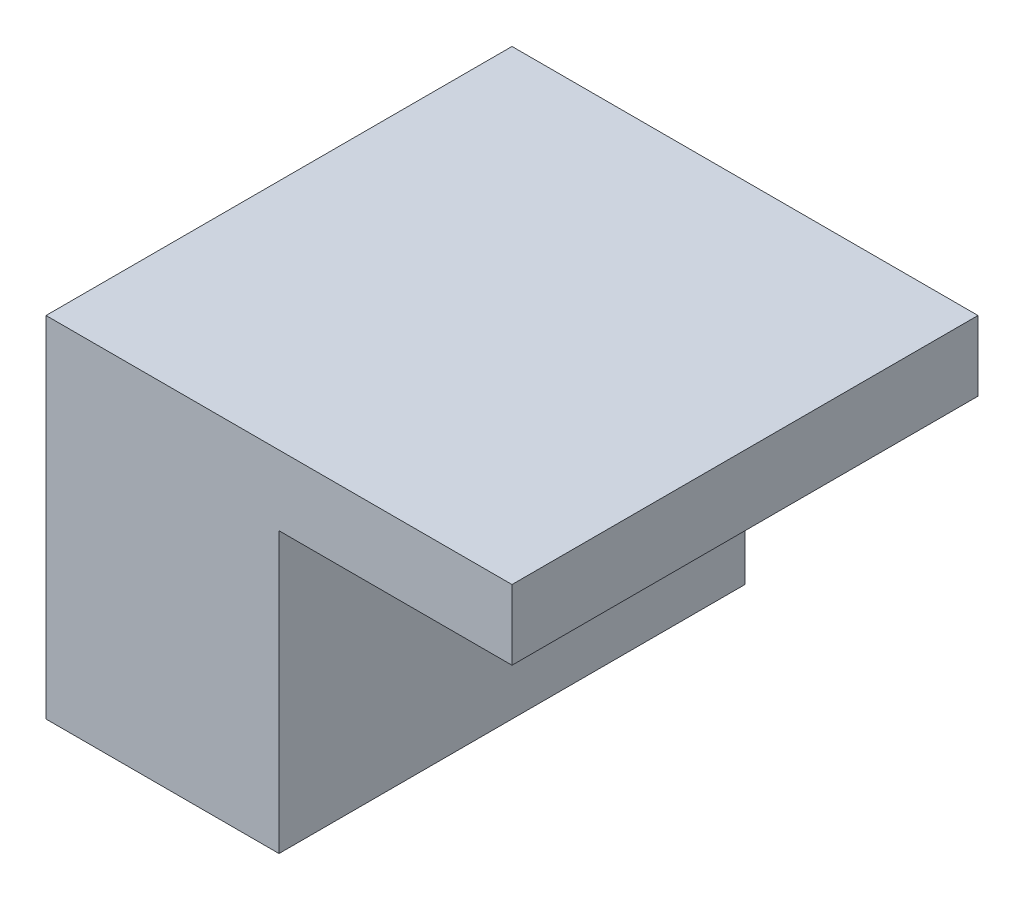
ISO-10303-21;
HEADER;
FILE_DESCRIPTION(('STEP AP214'),'2;1');
FILE_NAME('part.step','',(''),(''),'','','');
FILE_SCHEMA(('AUTOMOTIVE_DESIGN { 1 0 10303 214 1 1 1 1 }'));
ENDSEC;
DATA;
#1=APPLICATION_CONTEXT('core data for automotive mechanical design processes');
#2=APPLICATION_PROTOCOL_DEFINITION('international standard','automotive_design',2000,#1);
#3=PRODUCT_CONTEXT('',#1,'mechanical');
#4=PRODUCT('Part','Part','',(#3));
#5=PRODUCT_RELATED_PRODUCT_CATEGORY('part','',(#4));
#6=PRODUCT_DEFINITION_FORMATION('','',#4);
#7=PRODUCT_DEFINITION_CONTEXT('part definition',#1,'design');
#8=PRODUCT_DEFINITION('design','',#6,#7);
#9=PRODUCT_DEFINITION_SHAPE('','',#8);
#10=(LENGTH_UNIT() NAMED_UNIT(*) SI_UNIT(.MILLI.,.METRE.));
#11=(NAMED_UNIT(*) PLANE_ANGLE_UNIT() SI_UNIT($,.RADIAN.));
#12=(NAMED_UNIT(*) SI_UNIT($,.STERADIAN.) SOLID_ANGLE_UNIT());
#13=UNCERTAINTY_MEASURE_WITH_UNIT(LENGTH_MEASURE(1.E-05),#10,'distance_accuracy_value','');
#14=(GEOMETRIC_REPRESENTATION_CONTEXT(3) GLOBAL_UNCERTAINTY_ASSIGNED_CONTEXT((#13)) GLOBAL_UNIT_ASSIGNED_CONTEXT((#10,
#11,#12)) REPRESENTATION_CONTEXT('',''));
#15=CARTESIAN_POINT('',(0.,0.,0.));
#16=DIRECTION('',(0.,0.,1.));
#17=DIRECTION('',(1.,0.,0.));
#18=AXIS2_PLACEMENT_3D('',#15,#16,#17);
#19=CARTESIAN_POINT('',(0.,150.,-100.));
#20=DIRECTION('',(0.,0.,-1.));
#21=DIRECTION('',(-1.,0.,0.));
#22=AXIS2_PLACEMENT_3D('',#19,#20,#21);
#23=PLANE('',#22);
#24=DIRECTION('',(1.,0.,0.));
#25=VECTOR('',#24,1.);
#26=CARTESIAN_POINT('',(0.,0.,-100.));
#27=LINE('',#26,#25);
#28=CARTESIAN_POINT('',(-100.,0.,-100.));
#29=VERTEX_POINT('',#28);
#30=CARTESIAN_POINT('',(0.,0.,-100.));
#31=VERTEX_POINT('',#30);
#32=EDGE_CURVE('E167',#29,#31,#27,.T.);
#33=ORIENTED_EDGE('',*,*,#32,.F.);
#34=DIRECTION('',(0.,-1.,0.));
#35=VECTOR('',#34,1.);
#36=CARTESIAN_POINT('',(-100.,150.,-100.));
#37=LINE('',#36,#35);
#38=CARTESIAN_POINT('',(-100.,150.,-100.));
#39=VERTEX_POINT('',#38);
#40=EDGE_CURVE('E11',#39,#29,#37,.T.);
#41=ORIENTED_EDGE('',*,*,#40,.F.);
#42=DIRECTION('',(1.,0.,0.));
#43=VECTOR('',#42,1.);
#44=CARTESIAN_POINT('',(0.,150.,-100.));
#45=LINE('',#44,#43);
#46=CARTESIAN_POINT('',(100.,150.,-100.));
#47=VERTEX_POINT('',#46);
#48=EDGE_CURVE('E170',#39,#47,#45,.T.);
#49=ORIENTED_EDGE('',*,*,#48,.T.);
#50=DIRECTION('',(0.,1.,0.));
#51=VECTOR('',#50,1.);
#52=CARTESIAN_POINT('',(100.,120.,-100.));
#53=LINE('',#52,#51);
#54=CARTESIAN_POINT('',(100.,120.,-100.));
#55=VERTEX_POINT('',#54);
#56=EDGE_CURVE('E164',#55,#47,#53,.T.);
#57=ORIENTED_EDGE('',*,*,#56,.F.);
#58=DIRECTION('',(-1.,0.,0.));
#59=VECTOR('',#58,1.);
#60=CARTESIAN_POINT('',(0.,120.,-100.));
#61=LINE('',#60,#59);
#62=CARTESIAN_POINT('',(0.,120.,-100.));
#63=VERTEX_POINT('',#62);
#64=EDGE_CURVE('E150',#55,#63,#61,.T.);
#65=ORIENTED_EDGE('',*,*,#64,.T.);
#66=DIRECTION('',(0.,-1.,0.));
#67=VECTOR('',#66,1.);
#68=CARTESIAN_POINT('',(0.,150.,-100.));
#69=LINE('',#68,#67);
#70=EDGE_CURVE('E187',#63,#31,#69,.T.);
#71=ORIENTED_EDGE('',*,*,#70,.T.);
#72=EDGE_LOOP('',(#33,#41,#49,#57,#65,#71));
#73=FACE_BOUND('',#72,.T.);
#74=ADVANCED_FACE('F39',(#73),#23,.T.);
#75=CARTESIAN_POINT('',(-100.,150.,0.));
#76=DIRECTION('',(-1.,0.,0.));
#77=DIRECTION('',(0.,0.,1.));
#78=AXIS2_PLACEMENT_3D('',#75,#76,#77);
#79=PLANE('',#78);
#80=DIRECTION('',(0.,0.,-1.));
#81=VECTOR('',#80,1.);
#82=CARTESIAN_POINT('',(-100.,0.,0.));
#83=LINE('',#82,#81);
#84=CARTESIAN_POINT('',(-100.,0.,100.));
#85=VERTEX_POINT('',#84);
#86=EDGE_CURVE('E179',#85,#29,#83,.T.);
#87=ORIENTED_EDGE('',*,*,#86,.F.);
#88=DIRECTION('',(0.,-1.,0.));
#89=VECTOR('',#88,1.);
#90=CARTESIAN_POINT('',(-100.,150.,100.));
#91=LINE('',#90,#89);
#92=CARTESIAN_POINT('',(-100.,150.,100.));
#93=VERTEX_POINT('',#92);
#94=EDGE_CURVE('E49',#93,#85,#91,.T.);
#95=ORIENTED_EDGE('',*,*,#94,.F.);
#96=DIRECTION('',(0.,0.,-1.));
#97=VECTOR('',#96,1.);
#98=CARTESIAN_POINT('',(-100.,150.,0.));
#99=LINE('',#98,#97);
#100=EDGE_CURVE('E172',#93,#39,#99,.T.);
#101=ORIENTED_EDGE('',*,*,#100,.T.);
#102=ORIENTED_EDGE('',*,*,#40,.T.);
#103=EDGE_LOOP('',(#87,#95,#101,#102));
#104=FACE_BOUND('',#103,.T.);
#105=ADVANCED_FACE('F237',(#104),#79,.T.);
#106=CARTESIAN_POINT('',(0.,150.,100.));
#107=DIRECTION('',(0.,0.,-1.));
#108=DIRECTION('',(-1.,0.,0.));
#109=AXIS2_PLACEMENT_3D('',#106,#107,#108);
#110=PLANE('',#109);
#111=DIRECTION('',(1.,0.,0.));
#112=VECTOR('',#111,1.);
#113=CARTESIAN_POINT('',(0.,0.,100.));
#114=LINE('',#113,#112);
#115=CARTESIAN_POINT('',(0.,0.,100.));
#116=VERTEX_POINT('',#115);
#117=EDGE_CURVE('E182',#85,#116,#114,.T.);
#118=ORIENTED_EDGE('',*,*,#117,.T.);
#119=DIRECTION('',(0.,-1.,0.));
#120=VECTOR('',#119,1.);
#121=CARTESIAN_POINT('',(0.,150.,100.));
#122=LINE('',#121,#120);
#123=CARTESIAN_POINT('',(0.,120.,100.));
#124=VERTEX_POINT('',#123);
#125=EDGE_CURVE('E189',#124,#116,#122,.T.);
#126=ORIENTED_EDGE('',*,*,#125,.F.);
#127=DIRECTION('',(-1.,0.,0.));
#128=VECTOR('',#127,1.);
#129=CARTESIAN_POINT('',(0.,120.,100.));
#130=LINE('',#129,#128);
#131=CARTESIAN_POINT('',(100.,120.,100.));
#132=VERTEX_POINT('',#131);
#133=EDGE_CURVE('E156',#132,#124,#130,.T.);
#134=ORIENTED_EDGE('',*,*,#133,.F.);
#135=DIRECTION('',(0.,1.,0.));
#136=VECTOR('',#135,1.);
#137=CARTESIAN_POINT('',(100.,120.,100.));
#138=LINE('',#137,#136);
#139=CARTESIAN_POINT('',(100.,150.,100.));
#140=VERTEX_POINT('',#139);
#141=EDGE_CURVE('E161',#132,#140,#138,.T.);
#142=ORIENTED_EDGE('',*,*,#141,.T.);
#143=DIRECTION('',(1.,0.,0.));
#144=VECTOR('',#143,1.);
#145=CARTESIAN_POINT('',(0.,150.,100.));
#146=LINE('',#145,#144);
#147=EDGE_CURVE('E129',#93,#140,#146,.T.);
#148=ORIENTED_EDGE('',*,*,#147,.F.);
#149=ORIENTED_EDGE('',*,*,#94,.T.);
#150=EDGE_LOOP('',(#118,#126,#134,#142,#148,#149));
#151=FACE_BOUND('',#150,.T.);
#152=ADVANCED_FACE('F233',(#151),#110,.F.);
#153=CARTESIAN_POINT('',(0.,150.,0.));
#154=DIRECTION('',(1.,0.,0.));
#155=DIRECTION('',(0.,0.,-1.));
#156=AXIS2_PLACEMENT_3D('',#153,#154,#155);
#157=PLANE('',#156);
#158=DIRECTION('',(0.,0.,-1.));
#159=VECTOR('',#158,1.);
#160=CARTESIAN_POINT('',(0.,120.,0.));
#161=LINE('',#160,#159);
#162=EDGE_CURVE('E153',#124,#63,#161,.T.);
#163=ORIENTED_EDGE('',*,*,#162,.F.);
#164=ORIENTED_EDGE('',*,*,#125,.T.);
#165=DIRECTION('',(0.,0.,1.));
#166=VECTOR('',#165,1.);
#167=CARTESIAN_POINT('',(0.,0.,0.));
#168=LINE('',#167,#166);
#169=EDGE_CURVE('E173',#31,#116,#168,.T.);
#170=ORIENTED_EDGE('',*,*,#169,.F.);
#171=ORIENTED_EDGE('',*,*,#70,.F.);
#172=EDGE_LOOP('',(#163,#164,#170,#171));
#173=FACE_BOUND('',#172,.T.);
#174=ADVANCED_FACE('F226',(#173),#157,.T.);
#175=CARTESIAN_POINT('',(0.,150.,0.));
#176=DIRECTION('',(0.,1.,0.));
#177=DIRECTION('',(0.,0.,1.));
#178=AXIS2_PLACEMENT_3D('',#175,#176,#177);
#179=PLANE('',#178);
#180=ORIENTED_EDGE('',*,*,#48,.F.);
#181=ORIENTED_EDGE('',*,*,#100,.F.);
#182=ORIENTED_EDGE('',*,*,#147,.T.);
#183=DIRECTION('',(0.,0.,1.));
#184=VECTOR('',#183,1.);
#185=CARTESIAN_POINT('',(100.,150.,0.));
#186=LINE('',#185,#184);
#187=EDGE_CURVE('E149',#47,#140,#186,.T.);
#188=ORIENTED_EDGE('',*,*,#187,.F.);
#189=EDGE_LOOP('',(#180,#181,#182,#188));
#190=FACE_BOUND('',#189,.T.);
#191=ADVANCED_FACE('F223',(#190),#179,.T.);
#192=CARTESIAN_POINT('',(0.,0.,0.));
#193=DIRECTION('',(0.,1.,0.));
#194=DIRECTION('',(0.,0.,1.));
#195=AXIS2_PLACEMENT_3D('',#192,#193,#194);
#196=PLANE('',#195);
#197=ORIENTED_EDGE('',*,*,#32,.T.);
#198=ORIENTED_EDGE('',*,*,#169,.T.);
#199=ORIENTED_EDGE('',*,*,#117,.F.);
#200=ORIENTED_EDGE('',*,*,#86,.T.);
#201=EDGE_LOOP('',(#197,#198,#199,#200));
#202=FACE_BOUND('',#201,.T.);
#203=ADVANCED_FACE('F221',(#202),#196,.F.);
#204=CARTESIAN_POINT('',(100.,120.,0.));
#205=DIRECTION('',(-1.,0.,0.));
#206=DIRECTION('',(0.,0.,1.));
#207=AXIS2_PLACEMENT_3D('',#204,#205,#206);
#208=PLANE('',#207);
#209=ORIENTED_EDGE('',*,*,#187,.T.);
#210=ORIENTED_EDGE('',*,*,#141,.F.);
#211=DIRECTION('',(0.,0.,1.));
#212=VECTOR('',#211,1.);
#213=CARTESIAN_POINT('',(100.,120.,0.));
#214=LINE('',#213,#212);
#215=EDGE_CURVE('E159',#55,#132,#214,.T.);
#216=ORIENTED_EDGE('',*,*,#215,.F.);
#217=ORIENTED_EDGE('',*,*,#56,.T.);
#218=EDGE_LOOP('',(#209,#210,#216,#217));
#219=FACE_BOUND('',#218,.T.);
#220=ADVANCED_FACE('F217',(#219),#208,.F.);
#221=CARTESIAN_POINT('',(0.,120.,0.));
#222=DIRECTION('',(0.,-1.,0.));
#223=DIRECTION('',(0.,0.,-1.));
#224=AXIS2_PLACEMENT_3D('',#221,#222,#223);
#225=PLANE('',#224);
#226=ORIENTED_EDGE('',*,*,#64,.F.);
#227=ORIENTED_EDGE('',*,*,#215,.T.);
#228=ORIENTED_EDGE('',*,*,#133,.T.);
#229=ORIENTED_EDGE('',*,*,#162,.T.);
#230=EDGE_LOOP('',(#226,#227,#228,#229));
#231=FACE_BOUND('',#230,.T.);
#232=ADVANCED_FACE('F215',(#231),#225,.T.);
#233=CLOSED_SHELL('',(#74,#105,#152,#174,#191,#203,#220,#232));
#234=CARTESIAN_POINT('',(0.,120.,0.));
#235=DIRECTION('',(0.,-1.,0.));
#236=DIRECTION('',(0.,0.,-1.));
#237=AXIS2_PLACEMENT_3D('',#234,#235,#236);
#238=PLANE('',#237);
#239=DIRECTION('',(0.,0.,-1.));
#240=VECTOR('',#239,1.);
#241=CARTESIAN_POINT('',(-90.,120.,0.));
#242=LINE('',#241,#240);
#243=CARTESIAN_POINT('',(-90.,120.,90.));
#244=VERTEX_POINT('',#243);
#245=CARTESIAN_POINT('',(-90.,120.,-90.));
#246=VERTEX_POINT('',#245);
#247=EDGE_CURVE('E122',#244,#246,#242,.T.);
#248=ORIENTED_EDGE('',*,*,#247,.T.);
#249=DIRECTION('',(1.,0.,0.));
#250=VECTOR('',#249,1.);
#251=CARTESIAN_POINT('',(0.,120.,-90.));
#252=LINE('',#251,#250);
#253=CARTESIAN_POINT('',(-9.99999999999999,120.,-90.));
#254=VERTEX_POINT('',#253);
#255=EDGE_CURVE('E132',#246,#254,#252,.T.);
#256=ORIENTED_EDGE('',*,*,#255,.T.);
#257=DIRECTION('',(0.,0.,1.));
#258=VECTOR('',#257,1.);
#259=CARTESIAN_POINT('',(-9.99999999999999,120.,0.));
#260=LINE('',#259,#258);
#261=CARTESIAN_POINT('',(-9.99999999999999,120.,90.));
#262=VERTEX_POINT('',#261);
#263=EDGE_CURVE('E57',#254,#262,#260,.T.);
#264=ORIENTED_EDGE('',*,*,#263,.T.);
#265=DIRECTION('',(-1.,0.,0.));
#266=VECTOR('',#265,1.);
#267=CARTESIAN_POINT('',(0.,120.,90.));
#268=LINE('',#267,#266);
#269=EDGE_CURVE('E65',#262,#244,#268,.T.);
#270=ORIENTED_EDGE('',*,*,#269,.T.);
#271=EDGE_LOOP('',(#248,#256,#264,#270));
#272=FACE_BOUND('',#271,.T.);
#273=ADVANCED_FACE('F135',(#272),#238,.T.);
#274=CARTESIAN_POINT('',(0.,30.,0.));
#275=DIRECTION('',(0.,1.,0.));
#276=DIRECTION('',(0.,0.,1.));
#277=AXIS2_PLACEMENT_3D('',#274,#275,#276);
#278=PLANE('',#277);
#279=DIRECTION('',(0.,0.,-1.));
#280=VECTOR('',#279,1.);
#281=CARTESIAN_POINT('',(-9.99999999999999,30.,0.));
#282=LINE('',#281,#280);
#283=CARTESIAN_POINT('',(-9.99999999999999,30.,90.));
#284=VERTEX_POINT('',#283);
#285=CARTESIAN_POINT('',(-9.99999999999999,30.,-90.));
#286=VERTEX_POINT('',#285);
#287=EDGE_CURVE('E140',#284,#286,#282,.T.);
#288=ORIENTED_EDGE('',*,*,#287,.T.);
#289=DIRECTION('',(-1.,0.,0.));
#290=VECTOR('',#289,1.);
#291=CARTESIAN_POINT('',(0.,30.,-90.));
#292=LINE('',#291,#290);
#293=CARTESIAN_POINT('',(-90.,30.,-90.));
#294=VERTEX_POINT('',#293);
#295=EDGE_CURVE('E143',#286,#294,#292,.T.);
#296=ORIENTED_EDGE('',*,*,#295,.T.);
#297=DIRECTION('',(0.,0.,1.));
#298=VECTOR('',#297,1.);
#299=CARTESIAN_POINT('',(-90.,30.,0.));
#300=LINE('',#299,#298);
#301=CARTESIAN_POINT('',(-90.,30.,90.));
#302=VERTEX_POINT('',#301);
#303=EDGE_CURVE('E124',#294,#302,#300,.T.);
#304=ORIENTED_EDGE('',*,*,#303,.T.);
#305=DIRECTION('',(1.,0.,0.));
#306=VECTOR('',#305,1.);
#307=CARTESIAN_POINT('',(0.,30.,90.));
#308=LINE('',#307,#306);
#309=EDGE_CURVE('E146',#302,#284,#308,.T.);
#310=ORIENTED_EDGE('',*,*,#309,.T.);
#311=EDGE_LOOP('',(#288,#296,#304,#310));
#312=FACE_BOUND('',#311,.T.);
#313=ADVANCED_FACE('F197',(#312),#278,.T.);
#314=CARTESIAN_POINT('',(-90.,150.,0.));
#315=DIRECTION('',(1.,0.,0.));
#316=DIRECTION('',(0.,0.,-1.));
#317=AXIS2_PLACEMENT_3D('',#314,#315,#316);
#318=PLANE('',#317);
#319=ORIENTED_EDGE('',*,*,#247,.F.);
#320=DIRECTION('',(0.,-1.,0.));
#321=VECTOR('',#320,1.);
#322=CARTESIAN_POINT('',(-90.,150.,90.));
#323=LINE('',#322,#321);
#324=EDGE_CURVE('E128',#244,#302,#323,.T.);
#325=ORIENTED_EDGE('',*,*,#324,.T.);
#326=ORIENTED_EDGE('',*,*,#303,.F.);
#327=DIRECTION('',(0.,-1.,0.));
#328=VECTOR('',#327,1.);
#329=CARTESIAN_POINT('',(-90.,150.,-90.));
#330=LINE('',#329,#328);
#331=EDGE_CURVE('E118',#246,#294,#330,.T.);
#332=ORIENTED_EDGE('',*,*,#331,.F.);
#333=EDGE_LOOP('',(#319,#325,#326,#332));
#334=FACE_BOUND('',#333,.T.);
#335=ADVANCED_FACE('F120',(#334),#318,.T.);
#336=CARTESIAN_POINT('',(0.,150.,90.));
#337=DIRECTION('',(0.,0.,-1.));
#338=DIRECTION('',(-1.,0.,0.));
#339=AXIS2_PLACEMENT_3D('',#336,#337,#338);
#340=PLANE('',#339);
#341=ORIENTED_EDGE('',*,*,#269,.F.);
#342=DIRECTION('',(0.,-1.,0.));
#343=VECTOR('',#342,1.);
#344=CARTESIAN_POINT('',(-9.99999999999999,150.,90.));
#345=LINE('',#344,#343);
#346=EDGE_CURVE('E192',#262,#284,#345,.T.);
#347=ORIENTED_EDGE('',*,*,#346,.T.);
#348=ORIENTED_EDGE('',*,*,#309,.F.);
#349=ORIENTED_EDGE('',*,*,#324,.F.);
#350=EDGE_LOOP('',(#341,#347,#348,#349));
#351=FACE_BOUND('',#350,.T.);
#352=ADVANCED_FACE('F198',(#351),#340,.T.);
#353=CARTESIAN_POINT('',(-9.99999999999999,150.,0.));
#354=DIRECTION('',(-1.,0.,0.));
#355=DIRECTION('',(0.,0.,1.));
#356=AXIS2_PLACEMENT_3D('',#353,#354,#355);
#357=PLANE('',#356);
#358=ORIENTED_EDGE('',*,*,#263,.F.);
#359=DIRECTION('',(0.,-1.,0.));
#360=VECTOR('',#359,1.);
#361=CARTESIAN_POINT('',(-9.99999999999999,150.,-90.));
#362=LINE('',#361,#360);
#363=EDGE_CURVE('E43',#254,#286,#362,.T.);
#364=ORIENTED_EDGE('',*,*,#363,.T.);
#365=ORIENTED_EDGE('',*,*,#287,.F.);
#366=ORIENTED_EDGE('',*,*,#346,.F.);
#367=EDGE_LOOP('',(#358,#364,#365,#366));
#368=FACE_BOUND('',#367,.T.);
#369=ADVANCED_FACE('F195',(#368),#357,.T.);
#370=CARTESIAN_POINT('',(0.,150.,-90.));
#371=DIRECTION('',(0.,0.,1.));
#372=DIRECTION('',(1.,0.,0.));
#373=AXIS2_PLACEMENT_3D('',#370,#371,#372);
#374=PLANE('',#373);
#375=ORIENTED_EDGE('',*,*,#255,.F.);
#376=ORIENTED_EDGE('',*,*,#331,.T.);
#377=ORIENTED_EDGE('',*,*,#295,.F.);
#378=ORIENTED_EDGE('',*,*,#363,.F.);
#379=EDGE_LOOP('',(#375,#376,#377,#378));
#380=FACE_BOUND('',#379,.T.);
#381=ADVANCED_FACE('F41',(#380),#374,.T.);
#382=CLOSED_SHELL('',(#273,#313,#335,#352,#369,#381));
#383=ORIENTED_CLOSED_SHELL('',*,#382,.T.);
#384=BREP_WITH_VOIDS('B2',#233,(#383));
#385=ADVANCED_BREP_SHAPE_REPRESENTATION('',(#18,#384),#14);
#386=SHAPE_DEFINITION_REPRESENTATION(#9,#385);
ENDSEC;
END-ISO-10303-21;
